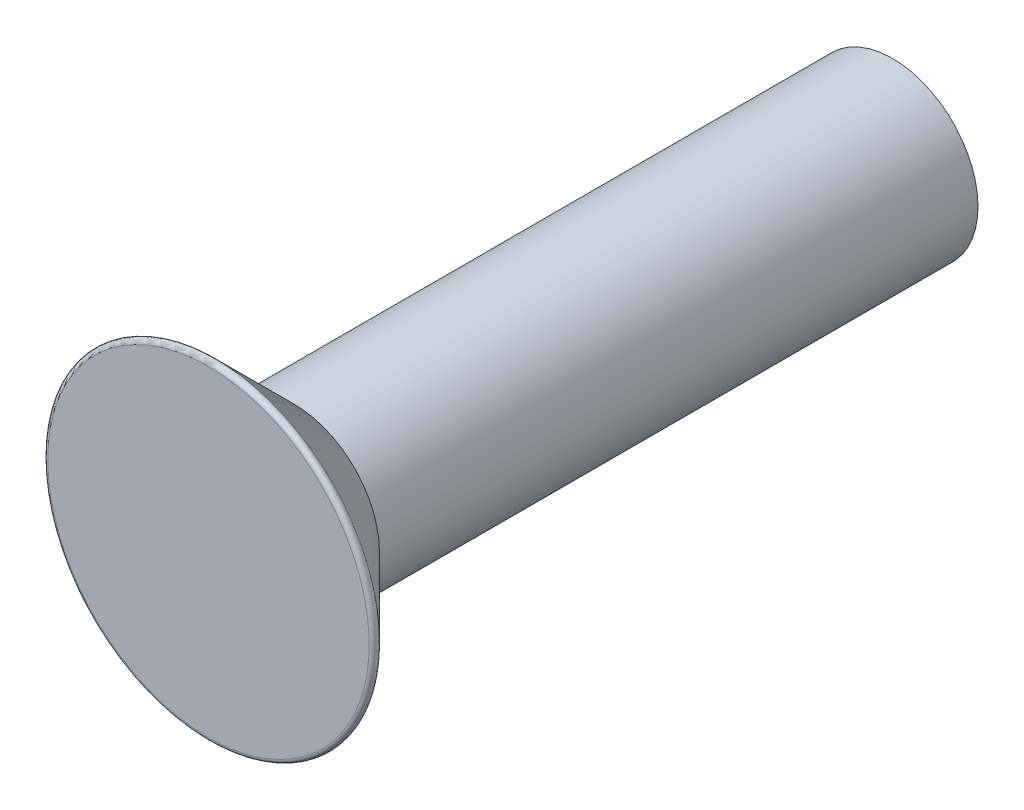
from build123d import *

# Parameters (mm, degrees)
FILLET_2_R = 0.15875


with BuildPart() as part:
    # BaseBodySke → BaseBody (revolve)
    with BuildSketch(Plane(origin=(0, 0, 0), x_dir=(1, 0, 0), z_dir=(0, 1, 0)), mode=Mode.PRIVATE) as basebody_sk:
        Polygon((0, 0), (-6.35, 0), (-3.175, 3.175), (-3.175, 25.4), (0, 25.4), align=None)
    revolve(basebody_sk.sketch.rotate(Axis((0, 0, 0), (0, 0, -1)), 180), axis=Axis((0, 0, 0), (0, 0, -1)))

    # Fillet 2
    fillet_2_edges = [part.edges().sort_by_distance(p)[0] for p in [
        (-6.35, 0, 0),
    ]]
    fillet(fillet_2_edges, radius=FILLET_2_R)


solid = part.part
